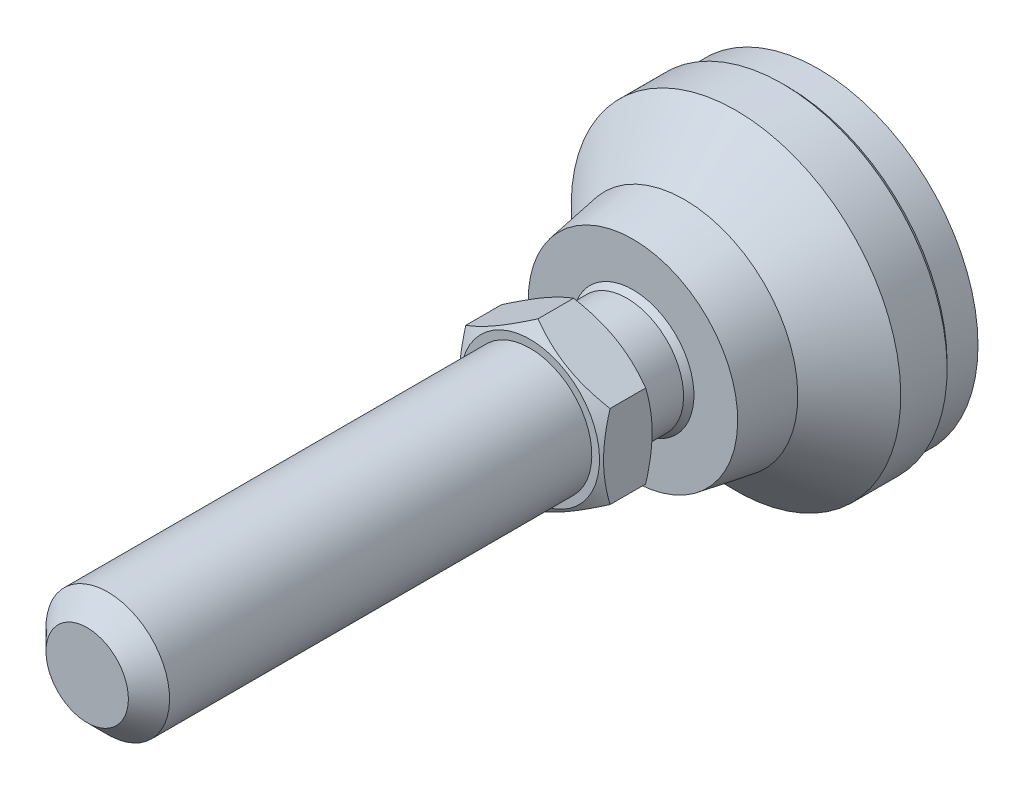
ISO-10303-21;
HEADER;
FILE_DESCRIPTION(('STEP AP214'),'2;1');
FILE_NAME('part.step','',(''),(''),'','','');
FILE_SCHEMA(('AUTOMOTIVE_DESIGN { 1 0 10303 214 1 1 1 1 }'));
ENDSEC;
DATA;
#1=APPLICATION_CONTEXT('core data for automotive mechanical design processes');
#2=APPLICATION_PROTOCOL_DEFINITION('international standard','automotive_design',2000,#1);
#3=PRODUCT_CONTEXT('',#1,'mechanical');
#4=PRODUCT('Part','Part','',(#3));
#5=PRODUCT_RELATED_PRODUCT_CATEGORY('part','',(#4));
#6=PRODUCT_DEFINITION_FORMATION('','',#4);
#7=PRODUCT_DEFINITION_CONTEXT('part definition',#1,'design');
#8=PRODUCT_DEFINITION('design','',#6,#7);
#9=PRODUCT_DEFINITION_SHAPE('','',#8);
#10=(LENGTH_UNIT() NAMED_UNIT(*) SI_UNIT(.MILLI.,.METRE.));
#11=(NAMED_UNIT(*) PLANE_ANGLE_UNIT() SI_UNIT($,.RADIAN.));
#12=(NAMED_UNIT(*) SI_UNIT($,.STERADIAN.) SOLID_ANGLE_UNIT());
#13=UNCERTAINTY_MEASURE_WITH_UNIT(LENGTH_MEASURE(1.E-05),#10,'distance_accuracy_value','');
#14=(GEOMETRIC_REPRESENTATION_CONTEXT(3) GLOBAL_UNCERTAINTY_ASSIGNED_CONTEXT((#13)) GLOBAL_UNIT_ASSIGNED_CONTEXT((#10,
#11,#12)) REPRESENTATION_CONTEXT('',''));
#15=CARTESIAN_POINT('',(0.,0.,0.));
#16=DIRECTION('',(0.,0.,1.));
#17=DIRECTION('',(1.,0.,0.));
#18=AXIS2_PLACEMENT_3D('',#15,#16,#17);
#19=CARTESIAN_POINT('',(0.,0.,3.));
#20=DIRECTION('',(0.,0.,-1.));
#21=DIRECTION('',(0.,1.,0.));
#22=AXIS2_PLACEMENT_3D('',#19,#20,#21);
#23=CYLINDRICAL_SURFACE('',#22,5.50000000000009);
#24=CARTESIAN_POINT('',(0.,0.,22.9999999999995));
#25=DIRECTION('',(0.,0.,-1.));
#26=DIRECTION('',(0.,1.,0.));
#27=AXIS2_PLACEMENT_3D('',#24,#25,#26);
#28=CIRCLE('',#27,5.50000000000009);
#29=CARTESIAN_POINT('',(0.,5.50000000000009,22.9999999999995));
#30=VERTEX_POINT('',#29);
#31=EDGE_CURVE('E112',#30,#30,#28,.T.);
#32=ORIENTED_EDGE('',*,*,#31,.T.);
#33=EDGE_LOOP('',(#32));
#34=FACE_BOUND('',#33,.T.);
#35=CARTESIAN_POINT('',(0.,0.,18.5902313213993));
#36=DIRECTION('',(0.,0.,-1.));
#37=DIRECTION('',(0.,1.,0.));
#38=AXIS2_PLACEMENT_3D('',#35,#36,#37);
#39=CIRCLE('',#38,5.50000000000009);
#40=CARTESIAN_POINT('',(-5.50000000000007,0.,18.5902313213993));
#41=VERTEX_POINT('',#40);
#42=EDGE_CURVE('E284',#41,#41,#39,.T.);
#43=ORIENTED_EDGE('',*,*,#42,.F.);
#44=EDGE_LOOP('',(#43));
#45=FACE_BOUND('',#44,.T.);
#46=ADVANCED_FACE('F14',(#34,#45),#23,.T.);
#47=CARTESIAN_POINT('',(0.,0.,14.2601043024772));
#48=DIRECTION('',(0.,0.,-1.));
#49=DIRECTION('',(-1.,0.,0.));
#50=AXIS2_PLACEMENT_3D('',#47,#48,#49);
#51=SPHERICAL_SURFACE('',#50,7.);
#52=CARTESIAN_POINT('',(0.,0.,18.));
#53=DIRECTION('',(0.,0.,-1.));
#54=DIRECTION('',(0.,1.,0.));
#55=AXIS2_PLACEMENT_3D('',#52,#53,#54);
#56=CIRCLE('',#55,5.91719360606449);
#57=CARTESIAN_POINT('',(-5.91719360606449,0.,18.));
#58=VERTEX_POINT('',#57);
#59=EDGE_CURVE('E115',#58,#58,#56,.T.);
#60=CARTESIAN_POINT('',(-5.50000000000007,0.,18.5902313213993));
#61=CARTESIAN_POINT('',(-5.50465946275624,0.,18.5843130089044));
#62=CARTESIAN_POINT('',(-5.50930937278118,0.,18.5783871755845));
#63=CARTESIAN_POINT('',(-5.51859003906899,0.,18.5665205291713));
#64=CARTESIAN_POINT('',(-5.52322079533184,0.,18.5605797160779));
#65=CARTESIAN_POINT('',(-5.53246310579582,0.,18.5486831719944));
#66=CARTESIAN_POINT('',(-5.53707465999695,0.,18.5427274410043));
#67=CARTESIAN_POINT('',(-5.54627851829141,0.,18.5308011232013));
#68=CARTESIAN_POINT('',(-5.55087082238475,0.,18.5248305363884));
#69=CARTESIAN_POINT('',(-5.56003613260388,0.,18.5128745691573));
#70=CARTESIAN_POINT('',(-5.56460913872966,0.,18.5068891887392));
#71=CARTESIAN_POINT('',(-5.57373580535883,0.,18.4949036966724));
#72=CARTESIAN_POINT('',(-5.57828946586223,0.,18.4889035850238));
#73=CARTESIAN_POINT('',(-5.58737739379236,0.,18.4768886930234));
#74=CARTESIAN_POINT('',(-5.59191166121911,0.,18.4708739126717));
#75=CARTESIAN_POINT('',(-5.60096075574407,0.,18.4588297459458));
#76=CARTESIAN_POINT('',(-5.60547558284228,0.,18.4528003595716));
#77=CARTESIAN_POINT('',(-5.6144857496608,0.,18.4407270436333));
#78=CARTESIAN_POINT('',(-5.61898108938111,0.,18.4346831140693));
#79=CARTESIAN_POINT('',(-5.62795223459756,0.,18.4225807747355));
#80=CARTESIAN_POINT('',(-5.6324280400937,0.,18.4165223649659));
#81=CARTESIAN_POINT('',(-5.64136007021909,0.,18.4043911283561));
#82=CARTESIAN_POINT('',(-5.64581629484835,0.,18.398318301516));
#83=CARTESIAN_POINT('',(-5.65470911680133,0.,18.3861582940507));
#84=CARTESIAN_POINT('',(-5.65914571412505,0.,18.3800711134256));
#85=CARTESIAN_POINT('',(-5.66799923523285,0.,18.3678824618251));
#86=CARTESIAN_POINT('',(-5.67241615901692,0.,18.3617809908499));
#87=CARTESIAN_POINT('',(-5.68123028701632,0.,18.3495638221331));
#88=CARTESIAN_POINT('',(-5.68562749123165,0.,18.3434481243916));
#89=CARTESIAN_POINT('',(-5.69440213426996,0.,18.3312025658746));
#90=CARTESIAN_POINT('',(-5.69877957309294,0.,18.3250727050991));
#91=CARTESIAN_POINT('',(-5.70751463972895,0.,18.3127988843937));
#92=CARTESIAN_POINT('',(-5.71187226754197,0.,18.3066549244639));
#93=CARTESIAN_POINT('',(-5.72056766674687,0.,18.2943529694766));
#94=CARTESIAN_POINT('',(-5.72490543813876,0.,18.2881949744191));
#95=CARTESIAN_POINT('',(-5.73356107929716,0.,18.2758650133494));
#96=CARTESIAN_POINT('',(-5.73787894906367,0.,18.2696930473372));
#97=CARTESIAN_POINT('',(-5.74649474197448,0.,18.2573352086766));
#98=CARTESIAN_POINT('',(-5.75079266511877,0.,18.2511493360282));
#99=CARTESIAN_POINT('',(-5.75936851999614,0.,18.2387637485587));
#100=CARTESIAN_POINT('',(-5.76364645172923,0.,18.2325640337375));
#101=CARTESIAN_POINT('',(-5.77218227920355,0.,18.2201508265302));
#102=CARTESIAN_POINT('',(-5.77644017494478,0.,18.2139373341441));
#103=CARTESIAN_POINT('',(-5.78493588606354,0.,18.2014966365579));
#104=CARTESIAN_POINT('',(-5.78917370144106,0.,18.195269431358));
#105=CARTESIAN_POINT('',(-5.79762920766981,0.,18.1828013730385));
#106=CARTESIAN_POINT('',(-5.80184689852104,0.,18.1765605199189));
#107=CARTESIAN_POINT('',(-5.81026211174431,0.,18.1640652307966));
#108=CARTESIAN_POINT('',(-5.81445963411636,0.,18.1578107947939));
#109=CARTESIAN_POINT('',(-5.82283446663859,0.,18.1452884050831));
#110=CARTESIAN_POINT('',(-5.82701177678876,0.,18.1390204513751));
#111=CARTESIAN_POINT('',(-5.83534614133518,0.,18.1264710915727));
#112=CARTESIAN_POINT('',(-5.83950319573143,0.,18.1201896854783));
#113=CARTESIAN_POINT('',(-5.84779700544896,0.,18.107613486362));
#114=CARTESIAN_POINT('',(-5.85193376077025,0.,18.1013186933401));
#115=CARTESIAN_POINT('',(-5.86018692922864,0.,18.0887157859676));
#116=CARTESIAN_POINT('',(-5.86430334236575,0.,18.082407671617));
#117=CARTESIAN_POINT('',(-5.87251578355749,0.,18.0697781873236));
#118=CARTESIAN_POINT('',(-5.87661181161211,0.,18.063456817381));
#119=CARTESIAN_POINT('',(-5.88478343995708,0.,18.0508008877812));
#120=CARTESIAN_POINT('',(-5.88885904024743,0.,18.044466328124));
#121=CARTESIAN_POINT('',(-5.89698977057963,0.,18.0317840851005));
#122=CARTESIAN_POINT('',(-5.90104490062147,0.,18.0254364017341));
#123=CARTESIAN_POINT('',(-5.909134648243,0.,18.0127279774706));
#124=CARTESIAN_POINT('',(-5.91316926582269,0.,18.0063672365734));
#125=CARTESIAN_POINT('',(-5.91719360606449,0.,18.));
#126=B_SPLINE_CURVE_WITH_KNOTS('',3,(#60,#61,#62,#63,#64,#65,#66,#67,#68,#69,#70,#71,#72,#73,
#74,#75,#76,#77,#78,#79,#80,#81,#82,#83,#84,#85,#86,#87,#88,#89,#90,#91,#92,#93,#94,#95,#96,#97,
#98,#99,#100,#101,#102,#103,#104,#105,#106,#107,#108,#109,#110,#111,#112,#113,#114,#115,#116,
#117,#118,#119,#120,#121,#122,#123,#124,#125),.UNSPECIFIED.,.F.,.F.,(4,2,2,2,2,2,2,2,2,2,2,2,2,
2,2,2,2,2,2,2,2,2,2,2,2,2,2,2,2,2,2,2,4),(0.,0.0225971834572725,0.0451943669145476,
0.067791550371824,0.0903887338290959,0.112985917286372,0.135583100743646,0.158180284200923,
0.180777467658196,0.203374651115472,0.225971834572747,0.24856901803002,0.271166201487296,
0.293763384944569,0.316360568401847,0.338957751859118,0.361554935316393,0.384152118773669,
0.406749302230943,0.429346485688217,0.451943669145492,0.474540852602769,0.49713803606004,
0.519735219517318,0.542332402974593,0.564929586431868,0.587526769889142,0.610123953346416,
0.632721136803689,0.655318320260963,0.67791550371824,0.700512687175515,0.723109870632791),.UNSPECIFIED.);
#127=EDGE_CURVE('BSEAM243',#41,#58,#126,.T.);
#128=ORIENTED_EDGE('',*,*,#42,.T.);
#129=ORIENTED_EDGE('',*,*,#59,.F.);
#130=ORIENTED_EDGE('',*,*,#127,.T.);
#131=ORIENTED_EDGE('',*,*,#127,.F.);
#132=EDGE_LOOP('',(#128,#130,#129,#131));
#133=FACE_BOUND('',#132,.T.);
#134=ADVANCED_FACE('F243',(#133),#51,.T.);
#135=CARTESIAN_POINT('',(0.,0.,3.5));
#136=DIRECTION('',(0.,0.,1.));
#137=DIRECTION('',(0.,-1.,0.));
#138=AXIS2_PLACEMENT_3D('',#135,#136,#137);
#139=CONICAL_SURFACE('',#138,16.,0.785398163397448);
#140=CARTESIAN_POINT('',(0.,0.,3.));
#141=DIRECTION('',(0.,0.,-1.));
#142=DIRECTION('',(0.,1.,0.));
#143=AXIS2_PLACEMENT_3D('',#140,#141,#142);
#144=CIRCLE('',#143,15.5);
#145=CARTESIAN_POINT('',(0.,15.5,3.));
#146=VERTEX_POINT('',#145);
#147=EDGE_CURVE('E85',#146,#146,#144,.T.);
#148=ORIENTED_EDGE('',*,*,#147,.F.);
#149=EDGE_LOOP('',(#148));
#150=FACE_BOUND('',#149,.T.);
#151=CARTESIAN_POINT('',(0.,0.,3.5));
#152=DIRECTION('',(0.,0.,-1.));
#153=DIRECTION('',(0.,1.,0.));
#154=AXIS2_PLACEMENT_3D('',#151,#152,#153);
#155=CIRCLE('',#154,16.);
#156=CARTESIAN_POINT('',(0.,16.,3.5));
#157=VERTEX_POINT('',#156);
#158=EDGE_CURVE('E88',#157,#157,#155,.T.);
#159=ORIENTED_EDGE('',*,*,#158,.T.);
#160=EDGE_LOOP('',(#159));
#161=FACE_BOUND('',#160,.T.);
#162=ADVANCED_FACE('F246',(#150,#161),#139,.T.);
#163=CARTESIAN_POINT('',(0.,0.,3.));
#164=DIRECTION('',(0.,0.,-1.));
#165=DIRECTION('',(0.,1.,0.));
#166=AXIS2_PLACEMENT_3D('',#163,#164,#165);
#167=CYLINDRICAL_SURFACE('',#166,16.);
#168=ORIENTED_EDGE('',*,*,#158,.F.);
#169=EDGE_LOOP('',(#168));
#170=FACE_BOUND('',#169,.T.);
#171=CARTESIAN_POINT('',(0.,0.,8.00000000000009));
#172=DIRECTION('',(0.,0.,-1.));
#173=DIRECTION('',(0.,1.,0.));
#174=AXIS2_PLACEMENT_3D('',#171,#172,#173);
#175=CIRCLE('',#174,16.);
#176=CARTESIAN_POINT('',(0.,16.,8.00000000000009));
#177=VERTEX_POINT('',#176);
#178=EDGE_CURVE('E105',#177,#177,#175,.T.);
#179=ORIENTED_EDGE('',*,*,#178,.T.);
#180=EDGE_LOOP('',(#179));
#181=FACE_BOUND('',#180,.T.);
#182=ADVANCED_FACE('F392',(#170,#181),#167,.T.);
#183=CARTESIAN_POINT('',(0.,0.,13.));
#184=DIRECTION('',(0.,0.,-1.));
#185=DIRECTION('',(0.,1.,0.));
#186=AXIS2_PLACEMENT_3D('',#183,#184,#185);
#187=CONICAL_SURFACE('',#186,11.,0.785398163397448);
#188=ORIENTED_EDGE('',*,*,#178,.F.);
#189=EDGE_LOOP('',(#188));
#190=FACE_BOUND('',#189,.T.);
#191=CARTESIAN_POINT('',(0.,0.,13.));
#192=DIRECTION('',(0.,0.,-1.));
#193=DIRECTION('',(0.,1.,0.));
#194=AXIS2_PLACEMENT_3D('',#191,#192,#193);
#195=CIRCLE('',#194,11.);
#196=CARTESIAN_POINT('',(0.,11.,13.));
#197=VERTEX_POINT('',#196);
#198=EDGE_CURVE('E108',#197,#197,#195,.T.);
#199=ORIENTED_EDGE('',*,*,#198,.T.);
#200=EDGE_LOOP('',(#199));
#201=FACE_BOUND('',#200,.T.);
#202=ADVANCED_FACE('F399',(#190,#201),#187,.T.);
#203=CARTESIAN_POINT('',(0.,0.,19.));
#204=DIRECTION('',(0.,0.,-1.));
#205=DIRECTION('',(0.,1.,0.));
#206=AXIS2_PLACEMENT_3D('',#203,#204,#205);
#207=CONICAL_SURFACE('',#206,10.,0.165148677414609);
#208=ORIENTED_EDGE('',*,*,#198,.F.);
#209=EDGE_LOOP('',(#208));
#210=FACE_BOUND('',#209,.T.);
#211=CARTESIAN_POINT('',(0.,0.,18.));
#212=DIRECTION('',(0.,0.,-1.));
#213=DIRECTION('',(0.,1.,0.));
#214=AXIS2_PLACEMENT_3D('',#211,#212,#213);
#215=CIRCLE('',#214,10.1666666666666);
#216=CARTESIAN_POINT('',(0.,10.1666666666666,18.));
#217=VERTEX_POINT('',#216);
#218=EDGE_CURVE('E93',#217,#217,#215,.T.);
#219=ORIENTED_EDGE('',*,*,#218,.T.);
#220=EDGE_LOOP('',(#219));
#221=FACE_BOUND('',#220,.T.);
#222=ADVANCED_FACE('F241',(#210,#221),#207,.T.);
#223=CARTESIAN_POINT('',(-6.60079601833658,0.,18.));
#224=DIRECTION('',(0.,0.,1.));
#225=DIRECTION('',(0.,-1.,0.));
#226=AXIS2_PLACEMENT_3D('',#223,#224,#225);
#227=PLANE('',#226);
#228=ORIENTED_EDGE('',*,*,#218,.F.);
#229=EDGE_LOOP('',(#228));
#230=FACE_BOUND('',#229,.T.);
#231=ORIENTED_EDGE('',*,*,#59,.T.);
#232=EDGE_LOOP('',(#231));
#233=FACE_BOUND('',#232,.T.);
#234=ADVANCED_FACE('F236',(#230,#233),#227,.T.);
#235=CARTESIAN_POINT('',(0.,-8.08290376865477,22.9999999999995));
#236=DIRECTION('',(0.,0.,-1.));
#237=DIRECTION('',(0.,1.,0.));
#238=AXIS2_PLACEMENT_3D('',#235,#236,#237);
#239=PLANE('',#238);
#240=CARTESIAN_POINT('',(0.,0.,22.9999999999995));
#241=DIRECTION('',(0.,0.,1.));
#242=DIRECTION('',(0.,-1.,0.));
#243=AXIS2_PLACEMENT_3D('',#240,#241,#242);
#244=CIRCLE('',#243,6.75);
#245=CARTESIAN_POINT('',(0.,-6.75,22.9999999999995));
#246=VERTEX_POINT('',#245);
#247=EDGE_CURVE('E80',#246,#246,#244,.T.);
#248=ORIENTED_EDGE('',*,*,#247,.F.);
#249=EDGE_LOOP('',(#248));
#250=FACE_BOUND('',#249,.T.);
#251=ORIENTED_EDGE('',*,*,#31,.F.);
#252=EDGE_LOOP('',(#251));
#253=FACE_BOUND('',#252,.T.);
#254=ADVANCED_FACE('F240',(#250,#253),#239,.T.);
#255=CARTESIAN_POINT('',(0.,0.,0.));
#256=DIRECTION('',(0.,0.,1.));
#257=DIRECTION('',(0.,-1.,0.));
#258=AXIS2_PLACEMENT_3D('',#255,#256,#257);
#259=CYLINDRICAL_SURFACE('',#258,15.5);
#260=CARTESIAN_POINT('',(0.,0.,0.));
#261=DIRECTION('',(0.,0.,-1.));
#262=DIRECTION('',(0.,1.,0.));
#263=AXIS2_PLACEMENT_3D('',#260,#261,#262);
#264=CIRCLE('',#263,15.5);
#265=CARTESIAN_POINT('',(0.,15.5,0.));
#266=VERTEX_POINT('',#265);
#267=EDGE_CURVE('E293',#266,#266,#264,.T.);
#268=ORIENTED_EDGE('',*,*,#267,.F.);
#269=EDGE_LOOP('',(#268));
#270=FACE_BOUND('',#269,.T.);
#271=ORIENTED_EDGE('',*,*,#147,.T.);
#272=EDGE_LOOP('',(#271));
#273=FACE_BOUND('',#272,.T.);
#274=ADVANCED_FACE('F250',(#270,#273),#259,.T.);
#275=CARTESIAN_POINT('',(0.,0.,0.));
#276=DIRECTION('',(0.,0.,-1.));
#277=DIRECTION('',(0.,1.,0.));
#278=AXIS2_PLACEMENT_3D('',#275,#276,#277);
#279=PLANE('',#278);
#280=ORIENTED_EDGE('',*,*,#267,.T.);
#281=EDGE_LOOP('',(#280));
#282=FACE_BOUND('',#281,.T.);
#283=ADVANCED_FACE('F133',(#282),#279,.T.);
#284=CARTESIAN_POINT('',(0.,0.,22.9999999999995));
#285=DIRECTION('',(0.,0.,1.));
#286=DIRECTION('',(0.,-1.,0.));
#287=AXIS2_PLACEMENT_3D('',#284,#285,#286);
#288=CONICAL_SURFACE('',#287,6.75,1.0471975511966);
#289=CARTESIAN_POINT('',(7.0002,-4.04133641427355,23.7696190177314));
#290=CARTESIAN_POINT('',(6.84633209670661,-4.13017208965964,23.7183374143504));
#291=CARTESIAN_POINT('',(6.69189049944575,-4.21933898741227,23.6693831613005));
#292=CARTESIAN_POINT('',(6.38175307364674,-4.3983969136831,23.576770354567));
#293=CARTESIAN_POINT('',(6.22605673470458,-4.4882882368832,23.5331140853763));
#294=CARTESIAN_POINT('',(5.75647483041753,-4.7594014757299,23.4109491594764));
#295=CARTESIAN_POINT('',(5.4407356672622,-4.94169356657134,23.3414631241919));
#296=CARTESIAN_POINT('',(4.96823775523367,-5.21449036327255,23.259982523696));
#297=CARTESIAN_POINT('',(4.81289077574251,-5.30417998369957,23.2367710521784));
#298=CARTESIAN_POINT('',(4.50149488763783,-5.48396448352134,23.1978487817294));
#299=CARTESIAN_POINT('',(4.34544604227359,-5.57405932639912,23.1821373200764));
#300=CARTESIAN_POINT('',(4.03307732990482,-5.75440548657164,23.15861548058));
#301=CARTESIAN_POINT('',(3.87675797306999,-5.84465650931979,23.1507961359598));
#302=CARTESIAN_POINT('',(3.56398349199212,-6.02523694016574,23.1432178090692));
#303=CARTESIAN_POINT('',(3.40752837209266,-6.11556634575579,23.1434585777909));
#304=CARTESIAN_POINT('',(2.97889312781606,-6.36303901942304,23.1551972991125));
#305=CARTESIAN_POINT('',(2.7068533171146,-6.52010127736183,23.1749033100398));
#306=CARTESIAN_POINT('',(2.1645805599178,-6.8331825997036,23.2373910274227));
#307=CARTESIAN_POINT('',(1.89434952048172,-6.98920056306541,23.2801940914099));
#308=CARTESIAN_POINT('',(1.35098545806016,-7.30291195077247,23.3871892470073));
#309=CARTESIAN_POINT('',(1.07792099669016,-7.46056579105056,23.4518346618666));
#310=CARTESIAN_POINT('',(0.535864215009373,-7.77352241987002,23.5985536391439));
#311=CARTESIAN_POINT('',(0.266864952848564,-7.92882921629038,23.6805927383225));
#312=CARTESIAN_POINT('',(-0.00019999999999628,-8.08301923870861,23.7696190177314));
#313=B_SPLINE_CURVE_WITH_KNOTS('',3,(#289,#290,#291,#292,#293,#294,#295,#296,#297,#298,#299,
#300,#301,#302,#303,#304,#305,#306,#307,#308,#309,#310,#311,#312),.UNSPECIFIED.,.F.,.F.,(4,2,2,
2,2,2,2,2,2,2,2,4),(0.,0.554727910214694,1.10969417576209,2.2219327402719,2.76443041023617,
3.30688013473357,3.8487128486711,4.39052882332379,5.33376515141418,6.27787517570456,
7.2429241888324,8.20607866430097),.UNSPECIFIED.);
#314=CARTESIAN_POINT('',(7.,-4.04145188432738,23.7695523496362));
#315=VERTEX_POINT('',#314);
#316=CARTESIAN_POINT('',(0.,-8.08290376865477,23.7695523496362));
#317=VERTEX_POINT('',#316);
#318=EDGE_CURVE('E33',#315,#317,#313,.T.);
#319=ORIENTED_EDGE('',*,*,#318,.T.);
#320=CARTESIAN_POINT('',(0.000200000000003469,-8.0830192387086,23.7696190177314));
#321=CARTESIAN_POINT('',(-0.15366790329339,-7.99418356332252,23.7183374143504));
#322=CARTESIAN_POINT('',(-0.308109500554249,-7.90501666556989,23.6693831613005));
#323=CARTESIAN_POINT('',(-0.618246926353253,-7.72595873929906,23.576770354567));
#324=CARTESIAN_POINT('',(-0.773943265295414,-7.63606741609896,23.5331140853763));
#325=CARTESIAN_POINT('',(-1.24352516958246,-7.36495417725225,23.4109491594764));
#326=CARTESIAN_POINT('',(-1.5592643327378,-7.18266208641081,23.3414631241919));
#327=CARTESIAN_POINT('',(-2.03176224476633,-6.90986528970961,23.259982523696));
#328=CARTESIAN_POINT('',(-2.18710922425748,-6.82017566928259,23.2367710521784));
#329=CARTESIAN_POINT('',(-2.49850511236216,-6.64039116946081,23.1978487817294));
#330=CARTESIAN_POINT('',(-2.65455395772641,-6.55029632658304,23.1821373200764));
#331=CARTESIAN_POINT('',(-2.96692267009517,-6.36995016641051,23.15861548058));
#332=CARTESIAN_POINT('',(-3.12324202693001,-6.27969914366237,23.1507961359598));
#333=CARTESIAN_POINT('',(-3.43601650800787,-6.09911871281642,23.1432178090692));
#334=CARTESIAN_POINT('',(-3.59247162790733,-6.00878930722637,23.1434585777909));
#335=CARTESIAN_POINT('',(-4.02110687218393,-5.76131663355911,23.1551972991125));
#336=CARTESIAN_POINT('',(-4.2931466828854,-5.60425437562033,23.1749033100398));
#337=CARTESIAN_POINT('',(-4.8354194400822,-5.29117305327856,23.2373910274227));
#338=CARTESIAN_POINT('',(-5.10565047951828,-5.13515508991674,23.2801940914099));
#339=CARTESIAN_POINT('',(-5.64901454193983,-4.82144370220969,23.3871892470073));
#340=CARTESIAN_POINT('',(-5.92207900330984,-4.6637898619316,23.4518346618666));
#341=CARTESIAN_POINT('',(-6.46413578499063,-4.35083323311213,23.5985536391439));
#342=CARTESIAN_POINT('',(-6.73313504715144,-4.19552643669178,23.6805927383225));
#343=CARTESIAN_POINT('',(-7.0002,-4.04133641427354,23.7696190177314));
#344=B_SPLINE_CURVE_WITH_KNOTS('',3,(#320,#321,#322,#323,#324,#325,#326,#327,#328,#329,#330,
#331,#332,#333,#334,#335,#336,#337,#338,#339,#340,#341,#342,#343),.UNSPECIFIED.,.F.,.F.,(4,2,2,
2,2,2,2,2,2,2,2,4),(0.,0.554727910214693,1.10969417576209,2.2219327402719,2.76443041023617,
3.30688013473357,3.8487128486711,4.39052882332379,5.33376515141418,6.27787517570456,
7.2429241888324,8.20607866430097),.UNSPECIFIED.);
#345=CARTESIAN_POINT('',(-7.,-4.04145188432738,23.7695523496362));
#346=VERTEX_POINT('',#345);
#347=EDGE_CURVE('E9',#317,#346,#344,.T.);
#348=ORIENTED_EDGE('',*,*,#347,.T.);
#349=CARTESIAN_POINT('',(-7.,10.8418307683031,26.5537311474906));
#350=CARTESIAN_POINT('',(-7.,10.5362110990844,26.4055345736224));
#351=CARTESIAN_POINT('',(-7.,10.2298883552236,26.2587630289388));
#352=CARTESIAN_POINT('',(-7.,9.61546275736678,25.9688717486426));
#353=CARTESIAN_POINT('',(-7.,9.30735963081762,25.8257525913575));
#354=CARTESIAN_POINT('',(-7.,8.68740516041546,25.543244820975));
#355=CARTESIAN_POINT('',(-7.,8.37554253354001,25.4038808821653));
#356=CARTESIAN_POINT('',(-7.,7.74933196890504,25.1308750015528));
#357=CARTESIAN_POINT('',(-7.,7.434984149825,24.9972327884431));
#358=CARTESIAN_POINT('',(-7.,6.79321212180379,24.7330272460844));
#359=CARTESIAN_POINT('',(-7.,6.46569083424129,24.6026984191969));
#360=CARTESIAN_POINT('',(-7.,5.80681211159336,24.351938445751));
#361=CARTESIAN_POINT('',(-7.,5.47545424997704,24.2315084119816));
#362=CARTESIAN_POINT('',(-7.,4.80899592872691,24.0037181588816));
#363=CARTESIAN_POINT('',(-7.,4.47390465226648,23.8963313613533));
#364=CARTESIAN_POINT('',(-7.,3.79892753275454,23.6980812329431));
#365=CARTESIAN_POINT('',(-7.,3.45904324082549,23.6072126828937));
#366=CARTESIAN_POINT('',(-7.,2.776113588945,23.4468574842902));
#367=CARTESIAN_POINT('',(-7.,2.43309607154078,23.3772554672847));
#368=CARTESIAN_POINT('',(-7.,1.91545738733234,23.2918227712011));
#369=CARTESIAN_POINT('',(-7.,1.74237961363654,23.2665057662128));
#370=CARTESIAN_POINT('',(-7.,1.39536854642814,23.2226920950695));
#371=CARTESIAN_POINT('',(-7.,1.22143533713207,23.2041947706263));
#372=CARTESIAN_POINT('',(-7.,0.875212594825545,23.1746202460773));
#373=CARTESIAN_POINT('',(-7.,0.702931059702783,23.163449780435));
#374=CARTESIAN_POINT('',(-7.,0.358050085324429,23.1484032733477));
#375=CARTESIAN_POINT('',(-7.,0.185450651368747,23.1445271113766));
#376=CARTESIAN_POINT('',(-7.,-0.15975778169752,23.1441616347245));
#377=CARTESIAN_POINT('',(-7.,-0.33236678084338,23.1476723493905));
#378=CARTESIAN_POINT('',(-7.,-0.677283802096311,23.1619950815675));
#379=CARTESIAN_POINT('',(-7.,-0.849591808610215,23.1728074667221));
#380=CARTESIAN_POINT('',(-7.,-1.26412351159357,23.2073744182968));
#381=CARTESIAN_POINT('',(-7.,-1.50606244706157,23.2346168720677));
#382=CARTESIAN_POINT('',(-7.,-1.98812408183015,23.3020075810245));
#383=CARTESIAN_POINT('',(-7.,-2.2282465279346,23.3421576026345));
#384=CARTESIAN_POINT('',(-7.,-2.94562604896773,23.4798382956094));
#385=CARTESIAN_POINT('',(-7.,-3.41962364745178,23.5945739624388));
#386=CARTESIAN_POINT('',(-7.,-4.1283605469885,23.793280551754));
#387=CARTESIAN_POINT('',(-7.,-4.36678241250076,23.8648699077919));
#388=CARTESIAN_POINT('',(-7.,-4.84130995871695,24.0154206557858));
#389=CARTESIAN_POINT('',(-7.,-5.07741562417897,24.0943820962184));
#390=CARTESIAN_POINT('',(-7.,-5.54738628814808,24.2584153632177));
#391=CARTESIAN_POINT('',(-7.,-5.78125201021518,24.3434851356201));
#392=CARTESIAN_POINT('',(-7.,-6.24705004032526,24.5187404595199));
#393=CARTESIAN_POINT('',(-7.,-6.47898237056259,24.6089259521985));
#394=CARTESIAN_POINT('',(-7.,-7.02452995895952,24.8268822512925));
#395=CARTESIAN_POINT('',(-7.,-7.33741732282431,24.9564715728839));
#396=CARTESIAN_POINT('',(-7.,-7.96054819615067,25.2218760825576));
#397=CARTESIAN_POINT('',(-7.,-8.27079154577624,25.3576916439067));
#398=CARTESIAN_POINT('',(-7.,-8.88911849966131,25.6343029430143));
#399=CARTESIAN_POINT('',(-7.,-9.19720166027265,25.7750996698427));
#400=CARTESIAN_POINT('',(-7.,-9.81151772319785,26.0606804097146));
#401=CARTESIAN_POINT('',(-7.,-10.1177505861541,26.2054645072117));
#402=CARTESIAN_POINT('',(-7.,-10.7289851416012,26.4984261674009));
#403=CARTESIAN_POINT('',(-7.,-11.0339851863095,26.6466071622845));
#404=CARTESIAN_POINT('',(-7.,-11.6426744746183,26.9456397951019));
#405=CARTESIAN_POINT('',(-7.,-11.946363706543,27.0964914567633));
#406=CARTESIAN_POINT('',(-7.,-12.8556975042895,27.5523046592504));
#407=CARTESIAN_POINT('',(-7.,-13.4596890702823,27.8605635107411));
#408=CARTESIAN_POINT('',(-7.,-14.6142001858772,28.4572911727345));
#409=CARTESIAN_POINT('',(-7.,-15.1649765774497,28.7452652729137));
#410=CARTESIAN_POINT('',(-7.,-16.2644822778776,29.3251386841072));
#411=CARTESIAN_POINT('',(-7.,-16.8132115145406,29.6170381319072));
#412=CARTESIAN_POINT('',(-7.,-17.9077179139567,30.2031029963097));
#413=CARTESIAN_POINT('',(-7.,-18.4534990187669,30.4972610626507));
#414=CARTESIAN_POINT('',(-7.,-19.5437514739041,31.0879246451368));
#415=CARTESIAN_POINT('',(-7.,-20.0882228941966,31.3844300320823));
#416=CARTESIAN_POINT('',(-7.,-20.632211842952,31.6818120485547));
#417=B_SPLINE_CURVE_WITH_KNOTS('',3,(#349,#350,#351,#352,#353,#354,#355,#356,#357,#358,#359,
#360,#361,#362,#363,#364,#365,#366,#367,#368,#369,#370,#371,#372,#373,#374,#375,#376,#377,#378,
#379,#380,#381,#382,#383,#384,#385,#386,#387,#388,#389,#390,#391,#392,#393,#394,#395,#396,#397,
#398,#399,#400,#401,#402,#403,#404,#405,#406,#407,#408,#409,#410,#411,#412,#413,#414,#415,#416),
.UNSPECIFIED.,.F.,.F.,(4,2,2,2,2,2,2,2,2,2,2,2,2,2,2,2,2,2,2,2,2,2,2,2,2,2,2,2,2,2,2,2,2,4),(0.,
1.01897789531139,2.03811614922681,3.06282638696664,4.08748798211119,5.14486190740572,
6.20235453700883,7.25765481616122,8.31262107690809,9.36175827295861,9.88640385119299,
10.4109987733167,10.9287792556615,11.4465511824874,11.9643251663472,12.4821252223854,
13.2121160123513,13.9422067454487,15.4032031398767,16.1499549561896,16.8967116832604,
17.6432184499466,18.3897166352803,19.4056116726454,20.4215676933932,21.4377265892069,
22.4539070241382,23.4711638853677,24.4884297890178,26.5226920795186,28.3872270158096,
30.2518270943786,32.1118354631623,33.9717421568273),.UNSPECIFIED.);
#418=CARTESIAN_POINT('',(-7.,4.04145188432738,23.7695523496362));
#419=VERTEX_POINT('',#418);
#420=EDGE_CURVE('E72',#346,#419,#417,.F.);
#421=ORIENTED_EDGE('',*,*,#420,.T.);
#422=CARTESIAN_POINT('',(-7.0002,4.04133641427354,23.7696190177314));
#423=CARTESIAN_POINT('',(-6.84633209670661,4.13017208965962,23.7183374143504));
#424=CARTESIAN_POINT('',(-6.69189049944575,4.21933898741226,23.6693831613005));
#425=CARTESIAN_POINT('',(-6.38175307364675,4.39839691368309,23.576770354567));
#426=CARTESIAN_POINT('',(-6.22605673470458,4.48828823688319,23.5331140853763));
#427=CARTESIAN_POINT('',(-5.75647483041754,4.75940147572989,23.4109491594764));
#428=CARTESIAN_POINT('',(-5.4407356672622,4.94169356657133,23.3414631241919));
#429=CARTESIAN_POINT('',(-4.96823775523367,5.21449036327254,23.259982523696));
#430=CARTESIAN_POINT('',(-4.81289077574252,5.30417998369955,23.2367710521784));
#431=CARTESIAN_POINT('',(-4.50149488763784,5.48396448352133,23.1978487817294));
#432=CARTESIAN_POINT('',(-4.34544604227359,5.57405932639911,23.1821373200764));
#433=CARTESIAN_POINT('',(-4.03307732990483,5.75440548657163,23.15861548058));
#434=CARTESIAN_POINT('',(-3.87675797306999,5.84465650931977,23.1507961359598));
#435=CARTESIAN_POINT('',(-3.56398349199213,6.02523694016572,23.1432178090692));
#436=CARTESIAN_POINT('',(-3.40752837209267,6.11556634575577,23.1434585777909));
#437=CARTESIAN_POINT('',(-2.97889312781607,6.36303901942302,23.1551972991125));
#438=CARTESIAN_POINT('',(-2.7068533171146,6.52010127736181,23.1749033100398));
#439=CARTESIAN_POINT('',(-2.16458055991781,6.83318259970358,23.2373910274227));
#440=CARTESIAN_POINT('',(-1.89434952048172,6.9892005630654,23.2801940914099));
#441=CARTESIAN_POINT('',(-1.35098545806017,7.30291195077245,23.3871892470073));
#442=CARTESIAN_POINT('',(-1.07792099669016,7.46056579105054,23.4518346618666));
#443=CARTESIAN_POINT('',(-0.535864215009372,7.77352241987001,23.5985536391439));
#444=CARTESIAN_POINT('',(-0.266864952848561,7.92882921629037,23.6805927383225));
#445=CARTESIAN_POINT('',(0.000199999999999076,8.0830192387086,23.7696190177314));
#446=B_SPLINE_CURVE_WITH_KNOTS('',3,(#422,#423,#424,#425,#426,#427,#428,#429,#430,#431,#432,
#433,#434,#435,#436,#437,#438,#439,#440,#441,#442,#443,#444,#445),.UNSPECIFIED.,.F.,.F.,(4,2,2,
2,2,2,2,2,2,2,2,4),(0.,0.554727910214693,1.10969417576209,2.2219327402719,2.76443041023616,
3.30688013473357,3.84871284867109,4.39052882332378,5.33376515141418,6.27787517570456,
7.2429241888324,8.20607866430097),.UNSPECIFIED.);
#447=CARTESIAN_POINT('',(0.,8.08290376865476,23.7695523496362));
#448=VERTEX_POINT('',#447);
#449=EDGE_CURVE('E79',#419,#448,#446,.T.);
#450=ORIENTED_EDGE('',*,*,#449,.T.);
#451=CARTESIAN_POINT('',(-0.000200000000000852,8.0830192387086,23.7696190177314));
#452=CARTESIAN_POINT('',(0.153667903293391,7.99418356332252,23.7183374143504));
#453=CARTESIAN_POINT('',(0.308109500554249,7.90501666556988,23.6693831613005));
#454=CARTESIAN_POINT('',(0.618246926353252,7.72595873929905,23.576770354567));
#455=CARTESIAN_POINT('',(0.773943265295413,7.63606741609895,23.5331140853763));
#456=CARTESIAN_POINT('',(1.24352516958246,7.36495417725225,23.4109491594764));
#457=CARTESIAN_POINT('',(1.5592643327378,7.18266208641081,23.3414631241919));
#458=CARTESIAN_POINT('',(2.03176224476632,6.9098652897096,23.259982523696));
#459=CARTESIAN_POINT('',(2.18710922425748,6.82017566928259,23.2367710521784));
#460=CARTESIAN_POINT('',(2.49850511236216,6.64039116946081,23.1978487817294));
#461=CARTESIAN_POINT('',(2.6545539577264,6.55029632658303,23.1821373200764));
#462=CARTESIAN_POINT('',(2.96692267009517,6.36995016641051,23.15861548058));
#463=CARTESIAN_POINT('',(3.12324202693,6.27969914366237,23.1507961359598));
#464=CARTESIAN_POINT('',(3.43601650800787,6.09911871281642,23.1432178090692));
#465=CARTESIAN_POINT('',(3.59247162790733,6.00878930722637,23.1434585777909));
#466=CARTESIAN_POINT('',(4.02110687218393,5.76131663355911,23.1551972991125));
#467=CARTESIAN_POINT('',(4.29314668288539,5.60425437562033,23.1749033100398));
#468=CARTESIAN_POINT('',(4.83541944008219,5.29117305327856,23.2373910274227));
#469=CARTESIAN_POINT('',(5.10565047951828,5.13515508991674,23.2801940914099));
#470=CARTESIAN_POINT('',(5.64901454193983,4.82144370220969,23.3871892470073));
#471=CARTESIAN_POINT('',(5.92207900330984,4.66378986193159,23.4518346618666));
#472=CARTESIAN_POINT('',(6.46413578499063,4.35083323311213,23.5985536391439));
#473=CARTESIAN_POINT('',(6.73313504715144,4.19552643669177,23.6805927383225));
#474=CARTESIAN_POINT('',(7.0002,4.04133641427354,23.7696190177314));
#475=B_SPLINE_CURVE_WITH_KNOTS('',3,(#451,#452,#453,#454,#455,#456,#457,#458,#459,#460,#461,
#462,#463,#464,#465,#466,#467,#468,#469,#470,#471,#472,#473,#474),.UNSPECIFIED.,.F.,.F.,(4,2,2,
2,2,2,2,2,2,2,2,4),(0.,0.554727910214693,1.10969417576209,2.2219327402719,2.76443041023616,
3.30688013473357,3.84871284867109,4.39052882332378,5.33376515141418,6.27787517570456,
7.2429241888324,8.20607866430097),.UNSPECIFIED.);
#476=CARTESIAN_POINT('',(7.,4.04145188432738,23.7695523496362));
#477=VERTEX_POINT('',#476);
#478=EDGE_CURVE('E194',#448,#477,#475,.T.);
#479=ORIENTED_EDGE('',*,*,#478,.T.);
#480=CARTESIAN_POINT('',(7.,10.8418307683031,26.5537311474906));
#481=CARTESIAN_POINT('',(7.,10.5362110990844,26.4055345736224));
#482=CARTESIAN_POINT('',(7.,10.2298883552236,26.2587630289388));
#483=CARTESIAN_POINT('',(7.,9.61546275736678,25.9688717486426));
#484=CARTESIAN_POINT('',(7.,9.30735963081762,25.8257525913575));
#485=CARTESIAN_POINT('',(7.,8.68740516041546,25.543244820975));
#486=CARTESIAN_POINT('',(7.,8.37554253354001,25.4038808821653));
#487=CARTESIAN_POINT('',(7.,7.74933196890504,25.1308750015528));
#488=CARTESIAN_POINT('',(7.,7.434984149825,24.9972327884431));
#489=CARTESIAN_POINT('',(7.,6.7932121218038,24.7330272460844));
#490=CARTESIAN_POINT('',(7.,6.46569083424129,24.6026984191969));
#491=CARTESIAN_POINT('',(7.,5.80681211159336,24.351938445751));
#492=CARTESIAN_POINT('',(7.,5.47545424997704,24.2315084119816));
#493=CARTESIAN_POINT('',(7.,4.80899592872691,24.0037181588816));
#494=CARTESIAN_POINT('',(7.,4.47390465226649,23.8963313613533));
#495=CARTESIAN_POINT('',(7.,3.79892753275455,23.6980812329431));
#496=CARTESIAN_POINT('',(7.,3.45904324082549,23.6072126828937));
#497=CARTESIAN_POINT('',(7.,2.77611358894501,23.4468574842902));
#498=CARTESIAN_POINT('',(7.,2.43309607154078,23.3772554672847));
#499=CARTESIAN_POINT('',(7.,1.91545738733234,23.2918227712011));
#500=CARTESIAN_POINT('',(7.,1.74237961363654,23.2665057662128));
#501=CARTESIAN_POINT('',(7.,1.39536854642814,23.2226920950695));
#502=CARTESIAN_POINT('',(7.,1.22143533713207,23.2041947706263));
#503=CARTESIAN_POINT('',(7.,0.875212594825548,23.1746202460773));
#504=CARTESIAN_POINT('',(7.,0.702931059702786,23.163449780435));
#505=CARTESIAN_POINT('',(7.,0.358050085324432,23.1484032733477));
#506=CARTESIAN_POINT('',(7.,0.185450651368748,23.1445271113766));
#507=CARTESIAN_POINT('',(7.,-0.159757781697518,23.1441616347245));
#508=CARTESIAN_POINT('',(7.,-0.332366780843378,23.1476723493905));
#509=CARTESIAN_POINT('',(7.,-0.677283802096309,23.1619950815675));
#510=CARTESIAN_POINT('',(7.,-0.849591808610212,23.1728074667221));
#511=CARTESIAN_POINT('',(7.,-1.26412351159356,23.2073744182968));
#512=CARTESIAN_POINT('',(7.,-1.50606244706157,23.2346168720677));
#513=CARTESIAN_POINT('',(7.,-1.98812408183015,23.3020075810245));
#514=CARTESIAN_POINT('',(7.,-2.2282465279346,23.3421576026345));
#515=CARTESIAN_POINT('',(7.,-2.94562604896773,23.4798382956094));
#516=CARTESIAN_POINT('',(7.,-3.41962364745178,23.5945739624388));
#517=CARTESIAN_POINT('',(7.,-4.1283605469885,23.793280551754));
#518=CARTESIAN_POINT('',(7.,-4.36678241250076,23.8648699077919));
#519=CARTESIAN_POINT('',(7.,-4.84130995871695,24.0154206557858));
#520=CARTESIAN_POINT('',(7.,-5.07741562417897,24.0943820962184));
#521=CARTESIAN_POINT('',(7.,-5.54738628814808,24.2584153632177));
#522=CARTESIAN_POINT('',(7.,-5.78125201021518,24.3434851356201));
#523=CARTESIAN_POINT('',(7.,-6.24705004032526,24.5187404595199));
#524=CARTESIAN_POINT('',(7.,-6.47898237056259,24.6089259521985));
#525=CARTESIAN_POINT('',(7.,-7.02452995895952,24.8268822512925));
#526=CARTESIAN_POINT('',(7.,-7.33741732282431,24.9564715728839));
#527=CARTESIAN_POINT('',(7.,-7.96054819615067,25.2218760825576));
#528=CARTESIAN_POINT('',(7.,-8.27079154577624,25.3576916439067));
#529=CARTESIAN_POINT('',(7.,-8.88911849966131,25.6343029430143));
#530=CARTESIAN_POINT('',(7.,-9.19720166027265,25.7750996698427));
#531=CARTESIAN_POINT('',(7.,-9.81151772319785,26.0606804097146));
#532=CARTESIAN_POINT('',(7.,-10.1177505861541,26.2054645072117));
#533=CARTESIAN_POINT('',(7.,-10.7289851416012,26.4984261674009));
#534=CARTESIAN_POINT('',(7.,-11.0339851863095,26.6466071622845));
#535=CARTESIAN_POINT('',(7.,-11.6426744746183,26.9456397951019));
#536=CARTESIAN_POINT('',(7.,-11.946363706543,27.0964914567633));
#537=CARTESIAN_POINT('',(7.,-12.8556975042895,27.5523046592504));
#538=CARTESIAN_POINT('',(7.,-13.4596890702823,27.8605635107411));
#539=CARTESIAN_POINT('',(7.,-14.6142001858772,28.4572911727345));
#540=CARTESIAN_POINT('',(7.,-15.1649765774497,28.7452652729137));
#541=CARTESIAN_POINT('',(7.,-16.2644822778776,29.3251386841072));
#542=CARTESIAN_POINT('',(7.,-16.8132115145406,29.6170381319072));
#543=CARTESIAN_POINT('',(7.,-17.9077179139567,30.2031029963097));
#544=CARTESIAN_POINT('',(7.,-18.4534990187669,30.4972610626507));
#545=CARTESIAN_POINT('',(7.,-19.5437514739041,31.0879246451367));
#546=CARTESIAN_POINT('',(7.,-20.0882228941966,31.3844300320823));
#547=CARTESIAN_POINT('',(7.,-20.632211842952,31.6818120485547));
#548=B_SPLINE_CURVE_WITH_KNOTS('',3,(#480,#481,#482,#483,#484,#485,#486,#487,#488,#489,#490,
#491,#492,#493,#494,#495,#496,#497,#498,#499,#500,#501,#502,#503,#504,#505,#506,#507,#508,#509,
#510,#511,#512,#513,#514,#515,#516,#517,#518,#519,#520,#521,#522,#523,#524,#525,#526,#527,#528,
#529,#530,#531,#532,#533,#534,#535,#536,#537,#538,#539,#540,#541,#542,#543,#544,#545,#546,#547),
.UNSPECIFIED.,.F.,.F.,(4,2,2,2,2,2,2,2,2,2,2,2,2,2,2,2,2,2,2,2,2,2,2,2,2,2,2,2,2,2,2,2,2,4),(0.,
1.01897789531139,2.03811614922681,3.06282638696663,4.08748798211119,5.14486190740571,
6.20235453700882,7.25765481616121,8.31262107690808,9.36175827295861,9.88640385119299,
10.4109987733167,10.9287792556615,11.4465511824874,11.9643251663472,12.4821252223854,
13.2121160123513,13.9422067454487,15.4032031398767,16.1499549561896,16.8967116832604,
17.6432184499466,18.3897166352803,19.4056116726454,20.4215676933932,21.4377265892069,
22.4539070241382,23.4711638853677,24.4884297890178,26.5226920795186,28.3872270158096,
30.2518270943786,32.1118354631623,33.9717421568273),.UNSPECIFIED.);
#549=EDGE_CURVE('E187',#477,#315,#548,.T.);
#550=ORIENTED_EDGE('',*,*,#549,.T.);
#551=EDGE_LOOP('',(#319,#348,#421,#450,#479,#550));
#552=FACE_BOUND('',#551,.T.);
#553=ORIENTED_EDGE('',*,*,#247,.T.);
#554=EDGE_LOOP('',(#553));
#555=FACE_BOUND('',#554,.T.);
#556=ADVANCED_FACE('F70',(#552,#555),#288,.T.);
#557=CARTESIAN_POINT('',(0.,0.,71.));
#558=DIRECTION('',(0.,0.,-1.));
#559=DIRECTION('',(0.,1.,0.));
#560=AXIS2_PLACEMENT_3D('',#557,#558,#559);
#561=PLANE('',#560);
#562=CARTESIAN_POINT('',(0.,0.,71.));
#563=DIRECTION('',(0.,0.,-1.));
#564=DIRECTION('',(0.,1.,0.));
#565=AXIS2_PLACEMENT_3D('',#562,#563,#564);
#566=CIRCLE('',#565,4.);
#567=CARTESIAN_POINT('',(0.,4.,71.));
#568=VERTEX_POINT('',#567);
#569=EDGE_CURVE('E116',#568,#568,#566,.T.);
#570=ORIENTED_EDGE('',*,*,#569,.F.);
#571=EDGE_LOOP('',(#570));
#572=FACE_BOUND('',#571,.T.);
#573=ADVANCED_FACE('F255',(#572),#561,.F.);
#574=CARTESIAN_POINT('',(0.,0.,71.));
#575=DIRECTION('',(0.,0.,-1.));
#576=DIRECTION('',(0.,1.,0.));
#577=AXIS2_PLACEMENT_3D('',#574,#575,#576);
#578=CONICAL_SURFACE('',#577,4.,0.785398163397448);
#579=CARTESIAN_POINT('',(0.,0.,69.));
#580=DIRECTION('',(0.,0.,-1.));
#581=DIRECTION('',(0.,1.,0.));
#582=AXIS2_PLACEMENT_3D('',#579,#580,#581);
#583=CIRCLE('',#582,6.);
#584=CARTESIAN_POINT('',(0.,6.,69.));
#585=VERTEX_POINT('',#584);
#586=EDGE_CURVE('E291',#585,#585,#583,.T.);
#587=ORIENTED_EDGE('',*,*,#586,.F.);
#588=EDGE_LOOP('',(#587));
#589=FACE_BOUND('',#588,.T.);
#590=ORIENTED_EDGE('',*,*,#569,.T.);
#591=EDGE_LOOP('',(#590));
#592=FACE_BOUND('',#591,.T.);
#593=ADVANCED_FACE('F258',(#589,#592),#578,.T.);
#594=CARTESIAN_POINT('',(0.,0.,3.));
#595=DIRECTION('',(0.,0.,-1.));
#596=DIRECTION('',(0.,1.,0.));
#597=AXIS2_PLACEMENT_3D('',#594,#595,#596);
#598=CYLINDRICAL_SURFACE('',#597,6.);
#599=CARTESIAN_POINT('',(0.,0.,27.9999999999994));
#600=DIRECTION('',(0.,0.,-1.));
#601=DIRECTION('',(0.,1.,0.));
#602=AXIS2_PLACEMENT_3D('',#599,#600,#601);
#603=CIRCLE('',#602,6.);
#604=CARTESIAN_POINT('',(0.,6.,27.9999999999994));
#605=VERTEX_POINT('',#604);
#606=EDGE_CURVE('E111',#605,#605,#603,.F.);
#607=ORIENTED_EDGE('',*,*,#606,.T.);
#608=EDGE_LOOP('',(#607));
#609=FACE_BOUND('',#608,.T.);
#610=ORIENTED_EDGE('',*,*,#586,.T.);
#611=EDGE_LOOP('',(#610));
#612=FACE_BOUND('',#611,.T.);
#613=ADVANCED_FACE('F254',(#609,#612),#598,.T.);
#614=CARTESIAN_POINT('',(-7.,12.1243556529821,27.9999999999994));
#615=DIRECTION('',(0.,0.,-1.));
#616=DIRECTION('',(0.,1.,0.));
#617=AXIS2_PLACEMENT_3D('',#614,#615,#616);
#618=PLANE('',#617);
#619=CARTESIAN_POINT('',(0.,0.,27.9999999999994));
#620=DIRECTION('',(0.,0.,1.));
#621=DIRECTION('',(0.,-1.,0.));
#622=AXIS2_PLACEMENT_3D('',#619,#620,#621);
#623=CIRCLE('',#622,6.75);
#624=CARTESIAN_POINT('',(0.,-6.75,27.9999999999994));
#625=VERTEX_POINT('',#624);
#626=EDGE_CURVE('E204',#625,#625,#623,.T.);
#627=ORIENTED_EDGE('',*,*,#626,.T.);
#628=EDGE_LOOP('',(#627));
#629=FACE_BOUND('',#628,.T.);
#630=ORIENTED_EDGE('',*,*,#606,.F.);
#631=EDGE_LOOP('',(#630));
#632=FACE_BOUND('',#631,.T.);
#633=ADVANCED_FACE('F130',(#629,#632),#618,.F.);
#634=CARTESIAN_POINT('',(0.,0.,26.2006387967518));
#635=DIRECTION('',(0.,0.,-1.));
#636=DIRECTION('',(0.,1.,0.));
#637=AXIS2_PLACEMENT_3D('',#634,#635,#636);
#638=CONICAL_SURFACE('',#637,9.86658502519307,1.0471975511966);
#639=CARTESIAN_POINT('',(-0.000199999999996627,-8.08301923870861,27.2303809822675));
#640=CARTESIAN_POINT('',(0.153667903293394,-7.99418356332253,27.2816625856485));
#641=CARTESIAN_POINT('',(0.308109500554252,-7.90501666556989,27.3306168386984));
#642=CARTESIAN_POINT('',(0.618246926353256,-7.72595873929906,27.4232296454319));
#643=CARTESIAN_POINT('',(0.773943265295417,-7.63606741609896,27.4668859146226));
#644=CARTESIAN_POINT('',(1.24352516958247,-7.36495417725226,27.5890508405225));
#645=CARTESIAN_POINT('',(1.5592643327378,-7.18266208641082,27.6585368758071));
#646=CARTESIAN_POINT('',(2.03176224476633,-6.90986528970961,27.7400174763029));
#647=CARTESIAN_POINT('',(2.18710922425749,-6.8201756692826,27.7632289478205));
#648=CARTESIAN_POINT('',(2.49850511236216,-6.64039116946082,27.8021512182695));
#649=CARTESIAN_POINT('',(2.65455395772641,-6.55029632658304,27.8178626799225));
#650=CARTESIAN_POINT('',(2.96692267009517,-6.36995016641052,27.8413845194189));
#651=CARTESIAN_POINT('',(3.12324202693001,-6.27969914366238,27.8492038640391));
#652=CARTESIAN_POINT('',(3.43601650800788,-6.09911871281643,27.8567821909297));
#653=CARTESIAN_POINT('',(3.59247162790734,-6.00878930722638,27.856541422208));
#654=CARTESIAN_POINT('',(4.02110687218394,-5.76131663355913,27.8448027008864));
#655=CARTESIAN_POINT('',(4.2931466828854,-5.60425437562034,27.8250966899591));
#656=CARTESIAN_POINT('',(4.8354194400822,-5.29117305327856,27.7626089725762));
#657=CARTESIAN_POINT('',(5.10565047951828,-5.13515508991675,27.719805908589));
#658=CARTESIAN_POINT('',(5.64901454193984,-4.8214437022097,27.6128107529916));
#659=CARTESIAN_POINT('',(5.92207900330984,-4.6637898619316,27.5481653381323));
#660=CARTESIAN_POINT('',(6.46413578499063,-4.35083323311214,27.401446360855));
#661=CARTESIAN_POINT('',(6.73313504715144,-4.19552643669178,27.3194072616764));
#662=CARTESIAN_POINT('',(7.0002,-4.04133641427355,27.2303809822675));
#663=B_SPLINE_CURVE_WITH_KNOTS('',3,(#639,#640,#641,#642,#643,#644,#645,#646,#647,#648,#649,
#650,#651,#652,#653,#654,#655,#656,#657,#658,#659,#660,#661,#662),.UNSPECIFIED.,.F.,.F.,(4,2,2,
2,2,2,2,2,2,2,2,4),(0.,0.554727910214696,1.10969417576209,2.2219327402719,2.76443041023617,
3.30688013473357,3.8487128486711,4.39052882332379,5.33376515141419,6.27787517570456,
7.2429241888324,8.20607866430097),.UNSPECIFIED.);
#664=CARTESIAN_POINT('',(0.,-8.08290376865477,27.2304476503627));
#665=VERTEX_POINT('',#664);
#666=CARTESIAN_POINT('',(7.,-4.04145188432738,27.2304476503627));
#667=VERTEX_POINT('',#666);
#668=EDGE_CURVE('E171',#665,#667,#663,.T.);
#669=ORIENTED_EDGE('',*,*,#668,.T.);
#670=CARTESIAN_POINT('',(7.,10.8418307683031,24.4462688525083));
#671=CARTESIAN_POINT('',(7.,10.5362110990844,24.5944654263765));
#672=CARTESIAN_POINT('',(7.,10.2298883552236,24.7412369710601));
#673=CARTESIAN_POINT('',(7.,9.61546275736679,25.0311282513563));
#674=CARTESIAN_POINT('',(7.,9.30735963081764,25.1742474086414));
#675=CARTESIAN_POINT('',(7.,8.68740516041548,25.4567551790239));
#676=CARTESIAN_POINT('',(7.,8.37554253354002,25.5961191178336));
#677=CARTESIAN_POINT('',(7.,7.74933196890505,25.8691249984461));
#678=CARTESIAN_POINT('',(7.,7.43498414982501,26.0027672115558));
#679=CARTESIAN_POINT('',(7.,6.79321212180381,26.2669727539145));
#680=CARTESIAN_POINT('',(7.,6.4656908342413,26.397301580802));
#681=CARTESIAN_POINT('',(7.,5.80681211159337,26.6480615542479));
#682=CARTESIAN_POINT('',(7.,5.47545424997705,26.7684915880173));
#683=CARTESIAN_POINT('',(7.,4.80899592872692,26.9962818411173));
#684=CARTESIAN_POINT('',(7.,4.47390465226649,27.1036686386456));
#685=CARTESIAN_POINT('',(7.,3.79892753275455,27.3019187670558));
#686=CARTESIAN_POINT('',(7.,3.45904324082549,27.3927873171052));
#687=CARTESIAN_POINT('',(7.,2.776113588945,27.5531425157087));
#688=CARTESIAN_POINT('',(7.,2.43309607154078,27.6227445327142));
#689=CARTESIAN_POINT('',(7.,1.91545738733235,27.7081772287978));
#690=CARTESIAN_POINT('',(7.,1.74237961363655,27.7334942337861));
#691=CARTESIAN_POINT('',(7.,1.39536854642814,27.7773079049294));
#692=CARTESIAN_POINT('',(7.,1.22143533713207,27.7958052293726));
#693=CARTESIAN_POINT('',(7.,0.875212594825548,27.8253797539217));
#694=CARTESIAN_POINT('',(7.,0.702931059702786,27.8365502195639));
#695=CARTESIAN_POINT('',(7.,0.358050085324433,27.8515967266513));
#696=CARTESIAN_POINT('',(7.,0.18545065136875,27.8554728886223));
#697=CARTESIAN_POINT('',(7.,-0.159757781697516,27.8558383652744));
#698=CARTESIAN_POINT('',(7.,-0.332366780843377,27.8523276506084));
#699=CARTESIAN_POINT('',(7.,-0.677283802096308,27.8380049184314));
#700=CARTESIAN_POINT('',(7.,-0.84959180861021,27.8271925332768));
#701=CARTESIAN_POINT('',(7.,-1.26412351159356,27.7926255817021));
#702=CARTESIAN_POINT('',(7.,-1.50606244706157,27.7653831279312));
#703=CARTESIAN_POINT('',(7.,-1.98812408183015,27.6979924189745));
#704=CARTESIAN_POINT('',(7.,-2.2282465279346,27.6578423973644));
#705=CARTESIAN_POINT('',(7.,-2.94562604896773,27.5201617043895));
#706=CARTESIAN_POINT('',(7.,-3.41962364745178,27.4054260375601));
#707=CARTESIAN_POINT('',(7.,-4.12836054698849,27.2067194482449));
#708=CARTESIAN_POINT('',(7.,-4.36678241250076,27.135130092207));
#709=CARTESIAN_POINT('',(7.,-4.84130995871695,26.9845793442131));
#710=CARTESIAN_POINT('',(7.,-5.07741562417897,26.9056179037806));
#711=CARTESIAN_POINT('',(7.,-5.54738628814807,26.7415846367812));
#712=CARTESIAN_POINT('',(7.,-5.78125201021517,26.6565148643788));
#713=CARTESIAN_POINT('',(7.,-6.24705004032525,26.481259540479));
#714=CARTESIAN_POINT('',(7.,-6.47898237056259,26.3910740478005));
#715=CARTESIAN_POINT('',(7.,-7.02452995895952,26.1731177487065));
#716=CARTESIAN_POINT('',(7.,-7.33741732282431,26.043528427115));
#717=CARTESIAN_POINT('',(7.,-7.96054819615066,25.7781239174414));
#718=CARTESIAN_POINT('',(7.,-8.27079154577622,25.6423083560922));
#719=CARTESIAN_POINT('',(7.,-8.8891184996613,25.3656970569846));
#720=CARTESIAN_POINT('',(7.,-9.19720166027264,25.2249003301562));
#721=CARTESIAN_POINT('',(7.,-9.81151772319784,24.9393195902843));
#722=CARTESIAN_POINT('',(7.,-10.1177505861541,24.7945354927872));
#723=CARTESIAN_POINT('',(7.,-10.7289851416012,24.5015738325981));
#724=CARTESIAN_POINT('',(7.,-11.0339851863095,24.3533928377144));
#725=CARTESIAN_POINT('',(7.,-11.6426744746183,24.0543602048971));
#726=CARTESIAN_POINT('',(7.,-11.946363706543,23.9035085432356));
#727=CARTESIAN_POINT('',(7.,-12.8556975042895,23.4476953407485));
#728=CARTESIAN_POINT('',(7.,-13.4596890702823,23.1394364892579));
#729=CARTESIAN_POINT('',(7.,-14.6142001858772,22.5427088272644));
#730=CARTESIAN_POINT('',(7.,-15.1649765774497,22.2547347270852));
#731=CARTESIAN_POINT('',(7.,-16.2644822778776,21.6748613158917));
#732=CARTESIAN_POINT('',(7.,-16.8132115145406,21.3829618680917));
#733=CARTESIAN_POINT('',(7.,-17.9077179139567,20.7968970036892));
#734=CARTESIAN_POINT('',(7.,-18.4534990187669,20.5027389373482));
#735=CARTESIAN_POINT('',(7.,-19.5437514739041,19.9120753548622));
#736=CARTESIAN_POINT('',(7.,-20.0882228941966,19.6155699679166));
#737=CARTESIAN_POINT('',(7.,-20.632211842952,19.3181879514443));
#738=B_SPLINE_CURVE_WITH_KNOTS('',3,(#670,#671,#672,#673,#674,#675,#676,#677,#678,#679,#680,
#681,#682,#683,#684,#685,#686,#687,#688,#689,#690,#691,#692,#693,#694,#695,#696,#697,#698,#699,
#700,#701,#702,#703,#704,#705,#706,#707,#708,#709,#710,#711,#712,#713,#714,#715,#716,#717,#718,
#719,#720,#721,#722,#723,#724,#725,#726,#727,#728,#729,#730,#731,#732,#733,#734,#735,#736,#737),
.UNSPECIFIED.,.F.,.F.,(4,2,2,2,2,2,2,2,2,2,2,2,2,2,2,2,2,2,2,2,2,2,2,2,2,2,2,2,2,2,2,2,2,4),(0.,
1.0189778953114,2.03811614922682,3.06282638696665,4.0874879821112,5.14486190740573,
6.20235453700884,7.25765481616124,8.31262107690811,9.36175827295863,9.88640385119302,
10.4109987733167,10.9287792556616,11.4465511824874,11.9643251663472,12.4821252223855,
13.2121160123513,13.9422067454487,15.4032031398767,16.1499549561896,16.8967116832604,
17.6432184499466,18.3897166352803,19.4056116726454,20.4215676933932,21.4377265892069,
22.4539070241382,23.4711638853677,24.4884297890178,26.5226920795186,28.3872270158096,
30.2518270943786,32.1118354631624,33.9717421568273),.UNSPECIFIED.);
#739=CARTESIAN_POINT('',(7.,4.04145188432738,27.2304476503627));
#740=VERTEX_POINT('',#739);
#741=EDGE_CURVE('E164',#667,#740,#738,.F.);
#742=ORIENTED_EDGE('',*,*,#741,.T.);
#743=CARTESIAN_POINT('',(7.0002,4.04133641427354,27.2303809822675));
#744=CARTESIAN_POINT('',(6.84633209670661,4.13017208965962,27.2816625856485));
#745=CARTESIAN_POINT('',(6.69189049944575,4.21933898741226,27.3306168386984));
#746=CARTESIAN_POINT('',(6.38175307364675,4.39839691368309,27.4232296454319));
#747=CARTESIAN_POINT('',(6.22605673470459,4.48828823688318,27.4668859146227));
#748=CARTESIAN_POINT('',(5.75647483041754,4.75940147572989,27.5890508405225));
#749=CARTESIAN_POINT('',(5.4407356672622,4.94169356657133,27.6585368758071));
#750=CARTESIAN_POINT('',(4.96823775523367,5.21449036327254,27.7400174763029));
#751=CARTESIAN_POINT('',(4.81289077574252,5.30417998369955,27.7632289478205));
#752=CARTESIAN_POINT('',(4.50149488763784,5.48396448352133,27.8021512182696));
#753=CARTESIAN_POINT('',(4.3454460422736,5.5740593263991,27.8178626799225));
#754=CARTESIAN_POINT('',(4.03307732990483,5.75440548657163,27.841384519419));
#755=CARTESIAN_POINT('',(3.87675797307,5.84465650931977,27.8492038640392));
#756=CARTESIAN_POINT('',(3.56398349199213,6.02523694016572,27.8567821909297));
#757=CARTESIAN_POINT('',(3.40752837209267,6.11556634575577,27.856541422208));
#758=CARTESIAN_POINT('',(2.97889312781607,6.36303901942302,27.8448027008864));
#759=CARTESIAN_POINT('',(2.7068533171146,6.52010127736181,27.8250966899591));
#760=CARTESIAN_POINT('',(2.1645805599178,6.83318259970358,27.7626089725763));
#761=CARTESIAN_POINT('',(1.89434952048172,6.9892005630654,27.719805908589));
#762=CARTESIAN_POINT('',(1.35098545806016,7.30291195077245,27.6128107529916));
#763=CARTESIAN_POINT('',(1.07792099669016,7.46056579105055,27.5481653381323));
#764=CARTESIAN_POINT('',(0.535864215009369,7.77352241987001,27.401446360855));
#765=CARTESIAN_POINT('',(0.266864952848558,7.92882921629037,27.3194072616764));
#766=CARTESIAN_POINT('',(-0.000200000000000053,8.0830192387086,27.2303809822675));
#767=B_SPLINE_CURVE_WITH_KNOTS('',3,(#743,#744,#745,#746,#747,#748,#749,#750,#751,#752,#753,
#754,#755,#756,#757,#758,#759,#760,#761,#762,#763,#764,#765,#766),.UNSPECIFIED.,.F.,.F.,(4,2,2,
2,2,2,2,2,2,2,2,4),(0.,0.554727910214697,1.10969417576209,2.2219327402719,2.76443041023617,
3.30688013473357,3.8487128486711,4.39052882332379,5.33376515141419,6.27787517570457,
7.2429241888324,8.20607866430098),.UNSPECIFIED.);
#768=CARTESIAN_POINT('',(0.,8.08290376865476,27.2304476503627));
#769=VERTEX_POINT('',#768);
#770=EDGE_CURVE('E157',#740,#769,#767,.T.);
#771=ORIENTED_EDGE('',*,*,#770,.T.);
#772=CARTESIAN_POINT('',(0.000199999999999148,8.0830192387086,27.2303809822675));
#773=CARTESIAN_POINT('',(-0.15366790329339,7.99418356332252,27.2816625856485));
#774=CARTESIAN_POINT('',(-0.308109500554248,7.90501666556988,27.3306168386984));
#775=CARTESIAN_POINT('',(-0.618246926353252,7.72595873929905,27.4232296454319));
#776=CARTESIAN_POINT('',(-0.773943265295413,7.63606741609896,27.4668859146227));
#777=CARTESIAN_POINT('',(-1.24352516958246,7.36495417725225,27.5890508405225));
#778=CARTESIAN_POINT('',(-1.5592643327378,7.18266208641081,27.6585368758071));
#779=CARTESIAN_POINT('',(-2.03176224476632,6.9098652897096,27.7400174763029));
#780=CARTESIAN_POINT('',(-2.18710922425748,6.82017566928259,27.7632289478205));
#781=CARTESIAN_POINT('',(-2.49850511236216,6.64039116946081,27.8021512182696));
#782=CARTESIAN_POINT('',(-2.6545539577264,6.55029632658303,27.8178626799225));
#783=CARTESIAN_POINT('',(-2.96692267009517,6.36995016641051,27.841384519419));
#784=CARTESIAN_POINT('',(-3.12324202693,6.27969914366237,27.8492038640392));
#785=CARTESIAN_POINT('',(-3.43601650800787,6.09911871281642,27.8567821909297));
#786=CARTESIAN_POINT('',(-3.59247162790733,6.00878930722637,27.856541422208));
#787=CARTESIAN_POINT('',(-4.02110687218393,5.76131663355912,27.8448027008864));
#788=CARTESIAN_POINT('',(-4.2931466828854,5.60425437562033,27.8250966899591));
#789=CARTESIAN_POINT('',(-4.83541944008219,5.29117305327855,27.7626089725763));
#790=CARTESIAN_POINT('',(-5.10565047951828,5.13515508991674,27.719805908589));
#791=CARTESIAN_POINT('',(-5.64901454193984,4.82144370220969,27.6128107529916));
#792=CARTESIAN_POINT('',(-5.92207900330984,4.66378986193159,27.5481653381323));
#793=CARTESIAN_POINT('',(-6.46413578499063,4.35083323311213,27.401446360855));
#794=CARTESIAN_POINT('',(-6.73313504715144,4.19552643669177,27.3194072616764));
#795=CARTESIAN_POINT('',(-7.0002,4.04133641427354,27.2303809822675));
#796=B_SPLINE_CURVE_WITH_KNOTS('',3,(#772,#773,#774,#775,#776,#777,#778,#779,#780,#781,#782,
#783,#784,#785,#786,#787,#788,#789,#790,#791,#792,#793,#794,#795),.UNSPECIFIED.,.F.,.F.,(4,2,2,
2,2,2,2,2,2,2,2,4),(0.,0.554727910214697,1.10969417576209,2.2219327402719,2.76443041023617,
3.30688013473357,3.8487128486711,4.39052882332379,5.33376515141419,6.27787517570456,
7.2429241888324,8.20607866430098),.UNSPECIFIED.);
#797=CARTESIAN_POINT('',(-7.,4.04145188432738,27.2304476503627));
#798=VERTEX_POINT('',#797);
#799=EDGE_CURVE('E150',#769,#798,#796,.T.);
#800=ORIENTED_EDGE('',*,*,#799,.T.);
#801=CARTESIAN_POINT('',(-7.,10.8418307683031,24.4462688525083));
#802=CARTESIAN_POINT('',(-7.,10.5362110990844,24.5944654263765));
#803=CARTESIAN_POINT('',(-7.,10.2298883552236,24.7412369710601));
#804=CARTESIAN_POINT('',(-7.,9.61546275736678,25.0311282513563));
#805=CARTESIAN_POINT('',(-7.,9.30735963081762,25.1742474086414));
#806=CARTESIAN_POINT('',(-7.,8.68740516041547,25.4567551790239));
#807=CARTESIAN_POINT('',(-7.,8.37554253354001,25.5961191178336));
#808=CARTESIAN_POINT('',(-7.,7.74933196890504,25.8691249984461));
#809=CARTESIAN_POINT('',(-7.,7.434984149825,26.0027672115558));
#810=CARTESIAN_POINT('',(-7.,6.7932121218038,26.2669727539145));
#811=CARTESIAN_POINT('',(-7.,6.46569083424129,26.397301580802));
#812=CARTESIAN_POINT('',(-7.,5.80681211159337,26.6480615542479));
#813=CARTESIAN_POINT('',(-7.,5.47545424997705,26.7684915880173));
#814=CARTESIAN_POINT('',(-7.,4.80899592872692,26.9962818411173));
#815=CARTESIAN_POINT('',(-7.,4.47390465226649,27.1036686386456));
#816=CARTESIAN_POINT('',(-7.,3.79892753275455,27.3019187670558));
#817=CARTESIAN_POINT('',(-7.,3.45904324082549,27.3927873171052));
#818=CARTESIAN_POINT('',(-7.,2.776113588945,27.5531425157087));
#819=CARTESIAN_POINT('',(-7.,2.43309607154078,27.6227445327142));
#820=CARTESIAN_POINT('',(-7.,1.91545738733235,27.7081772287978));
#821=CARTESIAN_POINT('',(-7.,1.74237961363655,27.7334942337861));
#822=CARTESIAN_POINT('',(-7.,1.39536854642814,27.7773079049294));
#823=CARTESIAN_POINT('',(-7.,1.22143533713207,27.7958052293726));
#824=CARTESIAN_POINT('',(-7.,0.875212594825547,27.8253797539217));
#825=CARTESIAN_POINT('',(-7.,0.702931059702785,27.8365502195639));
#826=CARTESIAN_POINT('',(-7.,0.358050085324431,27.8515967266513));
#827=CARTESIAN_POINT('',(-7.,0.185450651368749,27.8554728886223));
#828=CARTESIAN_POINT('',(-7.,-0.159757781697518,27.8558383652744));
#829=CARTESIAN_POINT('',(-7.,-0.332366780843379,27.8523276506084));
#830=CARTESIAN_POINT('',(-7.,-0.677283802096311,27.8380049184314));
#831=CARTESIAN_POINT('',(-7.,-0.849591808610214,27.8271925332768));
#832=CARTESIAN_POINT('',(-7.,-1.26412351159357,27.7926255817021));
#833=CARTESIAN_POINT('',(-7.,-1.50606244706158,27.7653831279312));
#834=CARTESIAN_POINT('',(-7.,-1.98812408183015,27.6979924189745));
#835=CARTESIAN_POINT('',(-7.,-2.2282465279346,27.6578423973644));
#836=CARTESIAN_POINT('',(-7.,-2.94562604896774,27.5201617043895));
#837=CARTESIAN_POINT('',(-7.,-3.41962364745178,27.4054260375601));
#838=CARTESIAN_POINT('',(-7.,-4.1283605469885,27.2067194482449));
#839=CARTESIAN_POINT('',(-7.,-4.36678241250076,27.135130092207));
#840=CARTESIAN_POINT('',(-7.,-4.84130995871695,26.9845793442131));
#841=CARTESIAN_POINT('',(-7.,-5.07741562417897,26.9056179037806));
#842=CARTESIAN_POINT('',(-7.,-5.54738628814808,26.7415846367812));
#843=CARTESIAN_POINT('',(-7.,-5.78125201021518,26.6565148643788));
#844=CARTESIAN_POINT('',(-7.,-6.24705004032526,26.481259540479));
#845=CARTESIAN_POINT('',(-7.,-6.4789823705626,26.3910740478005));
#846=CARTESIAN_POINT('',(-7.,-7.02452995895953,26.1731177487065));
#847=CARTESIAN_POINT('',(-7.,-7.33741732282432,26.043528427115));
#848=CARTESIAN_POINT('',(-7.,-7.96054819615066,25.7781239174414));
#849=CARTESIAN_POINT('',(-7.,-8.27079154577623,25.6423083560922));
#850=CARTESIAN_POINT('',(-7.,-8.88911849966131,25.3656970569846));
#851=CARTESIAN_POINT('',(-7.,-9.19720166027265,25.2249003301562));
#852=CARTESIAN_POINT('',(-7.,-9.81151772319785,24.9393195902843));
#853=CARTESIAN_POINT('',(-7.,-10.1177505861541,24.7945354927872));
#854=CARTESIAN_POINT('',(-7.,-10.7289851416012,24.501573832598));
#855=CARTESIAN_POINT('',(-7.,-11.0339851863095,24.3533928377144));
#856=CARTESIAN_POINT('',(-7.,-11.6426744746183,24.054360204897));
#857=CARTESIAN_POINT('',(-7.,-11.946363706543,23.9035085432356));
#858=CARTESIAN_POINT('',(-7.,-12.8556975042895,23.4476953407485));
#859=CARTESIAN_POINT('',(-7.,-13.4596890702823,23.1394364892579));
#860=CARTESIAN_POINT('',(-7.,-14.6142001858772,22.5427088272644));
#861=CARTESIAN_POINT('',(-7.,-15.1649765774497,22.2547347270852));
#862=CARTESIAN_POINT('',(-7.,-16.2644822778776,21.6748613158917));
#863=CARTESIAN_POINT('',(-7.,-16.8132115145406,21.3829618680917));
#864=CARTESIAN_POINT('',(-7.,-17.9077179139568,20.7968970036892));
#865=CARTESIAN_POINT('',(-7.,-18.4534990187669,20.5027389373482));
#866=CARTESIAN_POINT('',(-7.,-19.5437514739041,19.9120753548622));
#867=CARTESIAN_POINT('',(-7.,-20.0882228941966,19.6155699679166));
#868=CARTESIAN_POINT('',(-7.,-20.632211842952,19.3181879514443));
#869=B_SPLINE_CURVE_WITH_KNOTS('',3,(#801,#802,#803,#804,#805,#806,#807,#808,#809,#810,#811,
#812,#813,#814,#815,#816,#817,#818,#819,#820,#821,#822,#823,#824,#825,#826,#827,#828,#829,#830,
#831,#832,#833,#834,#835,#836,#837,#838,#839,#840,#841,#842,#843,#844,#845,#846,#847,#848,#849,
#850,#851,#852,#853,#854,#855,#856,#857,#858,#859,#860,#861,#862,#863,#864,#865,#866,#867,#868),
.UNSPECIFIED.,.F.,.F.,(4,2,2,2,2,2,2,2,2,2,2,2,2,2,2,2,2,2,2,2,2,2,2,2,2,2,2,2,2,2,2,2,2,4),(0.,
1.01897789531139,2.03811614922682,3.06282638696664,4.0874879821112,5.14486190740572,
6.20235453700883,7.25765481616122,8.31262107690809,9.36175827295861,9.886403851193,
10.4109987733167,10.9287792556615,11.4465511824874,11.9643251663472,12.4821252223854,
13.2121160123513,13.9422067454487,15.4032031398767,16.1499549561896,16.8967116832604,
17.6432184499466,18.3897166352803,19.4056116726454,20.4215676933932,21.4377265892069,
22.4539070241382,23.4711638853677,24.4884297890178,26.5226920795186,28.3872270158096,
30.2518270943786,32.1118354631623,33.9717421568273),.UNSPECIFIED.);
#870=CARTESIAN_POINT('',(-7.,-4.04145188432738,27.2304476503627));
#871=VERTEX_POINT('',#870);
#872=EDGE_CURVE('E141',#798,#871,#869,.T.);
#873=ORIENTED_EDGE('',*,*,#872,.T.);
#874=CARTESIAN_POINT('',(-7.0002,-4.04133641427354,27.2303809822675));
#875=CARTESIAN_POINT('',(-6.84633209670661,-4.13017208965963,27.2816625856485));
#876=CARTESIAN_POINT('',(-6.69189049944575,-4.21933898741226,27.3306168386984));
#877=CARTESIAN_POINT('',(-6.38175307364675,-4.39839691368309,27.4232296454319));
#878=CARTESIAN_POINT('',(-6.22605673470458,-4.48828823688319,27.4668859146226));
#879=CARTESIAN_POINT('',(-5.75647483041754,-4.7594014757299,27.5890508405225));
#880=CARTESIAN_POINT('',(-5.4407356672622,-4.94169356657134,27.6585368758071));
#881=CARTESIAN_POINT('',(-4.96823775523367,-5.21449036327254,27.7400174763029));
#882=CARTESIAN_POINT('',(-4.81289077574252,-5.30417998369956,27.7632289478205));
#883=CARTESIAN_POINT('',(-4.50149488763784,-5.48396448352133,27.8021512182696));
#884=CARTESIAN_POINT('',(-4.34544604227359,-5.57405932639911,27.8178626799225));
#885=CARTESIAN_POINT('',(-4.03307732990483,-5.75440548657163,27.841384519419));
#886=CARTESIAN_POINT('',(-3.87675797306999,-5.84465650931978,27.8492038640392));
#887=CARTESIAN_POINT('',(-3.56398349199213,-6.02523694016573,27.8567821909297));
#888=CARTESIAN_POINT('',(-3.40752837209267,-6.11556634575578,27.856541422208));
#889=CARTESIAN_POINT('',(-2.97889312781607,-6.36303901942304,27.8448027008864));
#890=CARTESIAN_POINT('',(-2.7068533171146,-6.52010127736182,27.8250966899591));
#891=CARTESIAN_POINT('',(-2.1645805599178,-6.83318259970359,27.7626089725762));
#892=CARTESIAN_POINT('',(-1.89434952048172,-6.98920056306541,27.719805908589));
#893=CARTESIAN_POINT('',(-1.35098545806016,-7.30291195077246,27.6128107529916));
#894=CARTESIAN_POINT('',(-1.07792099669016,-7.46056579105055,27.5481653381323));
#895=CARTESIAN_POINT('',(-0.535864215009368,-7.77352241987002,27.401446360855));
#896=CARTESIAN_POINT('',(-0.266864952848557,-7.92882921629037,27.3194072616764));
#897=CARTESIAN_POINT('',(0.000200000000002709,-8.0830192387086,27.2303809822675));
#898=B_SPLINE_CURVE_WITH_KNOTS('',3,(#874,#875,#876,#877,#878,#879,#880,#881,#882,#883,#884,
#885,#886,#887,#888,#889,#890,#891,#892,#893,#894,#895,#896,#897),.UNSPECIFIED.,.F.,.F.,(4,2,2,
2,2,2,2,2,2,2,2,4),(0.,0.554727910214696,1.10969417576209,2.2219327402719,2.76443041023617,
3.30688013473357,3.8487128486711,4.39052882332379,5.33376515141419,6.27787517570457,
7.2429241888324,8.20607866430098),.UNSPECIFIED.);
#899=EDGE_CURVE('E27',#871,#665,#898,.T.);
#900=ORIENTED_EDGE('',*,*,#899,.T.);
#901=EDGE_LOOP('',(#669,#742,#771,#800,#873,#900));
#902=FACE_BOUND('',#901,.T.);
#903=ORIENTED_EDGE('',*,*,#626,.F.);
#904=EDGE_LOOP('',(#903));
#905=FACE_BOUND('',#904,.T.);
#906=ADVANCED_FACE('F126',(#902,#905),#638,.T.);
#907=CARTESIAN_POINT('',(-7.,-4.04145188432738,23.9999999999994));
#908=DIRECTION('',(-0.5,-0.866025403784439,0.));
#909=DIRECTION('',(0.866025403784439,-0.5,0.));
#910=AXIS2_PLACEMENT_3D('',#907,#908,#909);
#911=PLANE('',#910);
#912=ORIENTED_EDGE('',*,*,#347,.F.);
#913=DIRECTION('',(0.,0.,1.));
#914=VECTOR('',#913,1.);
#915=CARTESIAN_POINT('',(0.,-8.08290376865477,23.9999999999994));
#916=LINE('',#915,#914);
#917=EDGE_CURVE('E101',#317,#665,#916,.T.);
#918=ORIENTED_EDGE('',*,*,#917,.T.);
#919=ORIENTED_EDGE('',*,*,#899,.F.);
#920=DIRECTION('',(0.,0.,1.));
#921=VECTOR('',#920,1.);
#922=CARTESIAN_POINT('',(-7.,-4.04145188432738,23.9999999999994));
#923=LINE('',#922,#921);
#924=EDGE_CURVE('E41',#346,#871,#923,.T.);
#925=ORIENTED_EDGE('',*,*,#924,.F.);
#926=EDGE_LOOP('',(#912,#918,#919,#925));
#927=FACE_BOUND('',#926,.T.);
#928=ADVANCED_FACE('F83',(#927),#911,.T.);
#929=CARTESIAN_POINT('',(-7.,4.04145188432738,23.9999999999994));
#930=DIRECTION('',(-1.,0.,0.));
#931=DIRECTION('',(0.,-1.,0.));
#932=AXIS2_PLACEMENT_3D('',#929,#930,#931);
#933=PLANE('',#932);
#934=ORIENTED_EDGE('',*,*,#420,.F.);
#935=ORIENTED_EDGE('',*,*,#924,.T.);
#936=ORIENTED_EDGE('',*,*,#872,.F.);
#937=DIRECTION('',(0.,0.,1.));
#938=VECTOR('',#937,1.);
#939=CARTESIAN_POINT('',(-7.,4.04145188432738,23.9999999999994));
#940=LINE('',#939,#938);
#941=EDGE_CURVE('E78',#419,#798,#940,.T.);
#942=ORIENTED_EDGE('',*,*,#941,.F.);
#943=EDGE_LOOP('',(#934,#935,#936,#942));
#944=FACE_BOUND('',#943,.T.);
#945=ADVANCED_FACE('F77',(#944),#933,.T.);
#946=CARTESIAN_POINT('',(0.,8.08290376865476,23.9999999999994));
#947=DIRECTION('',(-0.5,0.866025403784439,0.));
#948=DIRECTION('',(-0.866025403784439,-0.5,0.));
#949=AXIS2_PLACEMENT_3D('',#946,#947,#948);
#950=PLANE('',#949);
#951=ORIENTED_EDGE('',*,*,#449,.F.);
#952=ORIENTED_EDGE('',*,*,#941,.T.);
#953=ORIENTED_EDGE('',*,*,#799,.F.);
#954=DIRECTION('',(0.,0.,1.));
#955=VECTOR('',#954,1.);
#956=CARTESIAN_POINT('',(0.,8.08290376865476,23.9999999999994));
#957=LINE('',#956,#955);
#958=EDGE_CURVE('E90',#448,#769,#957,.T.);
#959=ORIENTED_EDGE('',*,*,#958,.F.);
#960=EDGE_LOOP('',(#951,#952,#953,#959));
#961=FACE_BOUND('',#960,.T.);
#962=ADVANCED_FACE('F219',(#961),#950,.T.);
#963=CARTESIAN_POINT('',(7.,4.04145188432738,23.9999999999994));
#964=DIRECTION('',(0.5,0.866025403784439,0.));
#965=DIRECTION('',(-0.866025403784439,0.5,0.));
#966=AXIS2_PLACEMENT_3D('',#963,#964,#965);
#967=PLANE('',#966);
#968=ORIENTED_EDGE('',*,*,#478,.F.);
#969=ORIENTED_EDGE('',*,*,#958,.T.);
#970=ORIENTED_EDGE('',*,*,#770,.F.);
#971=DIRECTION('',(0.,0.,1.));
#972=VECTOR('',#971,1.);
#973=CARTESIAN_POINT('',(7.,4.04145188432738,23.9999999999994));
#974=LINE('',#973,#972);
#975=EDGE_CURVE('E97',#477,#740,#974,.T.);
#976=ORIENTED_EDGE('',*,*,#975,.F.);
#977=EDGE_LOOP('',(#968,#969,#970,#976));
#978=FACE_BOUND('',#977,.T.);
#979=ADVANCED_FACE('F181',(#978),#967,.T.);
#980=CARTESIAN_POINT('',(7.,-4.04145188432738,23.9999999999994));
#981=DIRECTION('',(1.,0.,0.));
#982=DIRECTION('',(0.,1.,0.));
#983=AXIS2_PLACEMENT_3D('',#980,#981,#982);
#984=PLANE('',#983);
#985=ORIENTED_EDGE('',*,*,#549,.F.);
#986=ORIENTED_EDGE('',*,*,#975,.T.);
#987=ORIENTED_EDGE('',*,*,#741,.F.);
#988=DIRECTION('',(0.,0.,1.));
#989=VECTOR('',#988,1.);
#990=CARTESIAN_POINT('',(7.,-4.04145188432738,23.9999999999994));
#991=LINE('',#990,#989);
#992=EDGE_CURVE('E99',#315,#667,#991,.T.);
#993=ORIENTED_EDGE('',*,*,#992,.F.);
#994=EDGE_LOOP('',(#985,#986,#987,#993));
#995=FACE_BOUND('',#994,.T.);
#996=ADVANCED_FACE('F177',(#995),#984,.T.);
#997=CARTESIAN_POINT('',(0.,-8.08290376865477,23.9999999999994));
#998=DIRECTION('',(0.5,-0.866025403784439,0.));
#999=DIRECTION('',(0.866025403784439,0.5,0.));
#1000=AXIS2_PLACEMENT_3D('',#997,#998,#999);
#1001=PLANE('',#1000);
#1002=ORIENTED_EDGE('',*,*,#318,.F.);
#1003=ORIENTED_EDGE('',*,*,#992,.T.);
#1004=ORIENTED_EDGE('',*,*,#668,.F.);
#1005=ORIENTED_EDGE('',*,*,#917,.F.);
#1006=EDGE_LOOP('',(#1002,#1003,#1004,#1005));
#1007=FACE_BOUND('',#1006,.T.);
#1008=ADVANCED_FACE('F180',(#1007),#1001,.T.);
#1009=CLOSED_SHELL('',(#46,#134,#162,#182,#202,#222,#234,#254,#274,#283,#556,#573,#593,#613,
#633,#906,#928,#945,#962,#979,#996,#1008));
#1010=MANIFOLD_SOLID_BREP('B1',#1009);
#1011=ADVANCED_BREP_SHAPE_REPRESENTATION('',(#18,#1010),#14);
#1012=SHAPE_DEFINITION_REPRESENTATION(#9,#1011);
ENDSEC;
END-ISO-10303-21;
